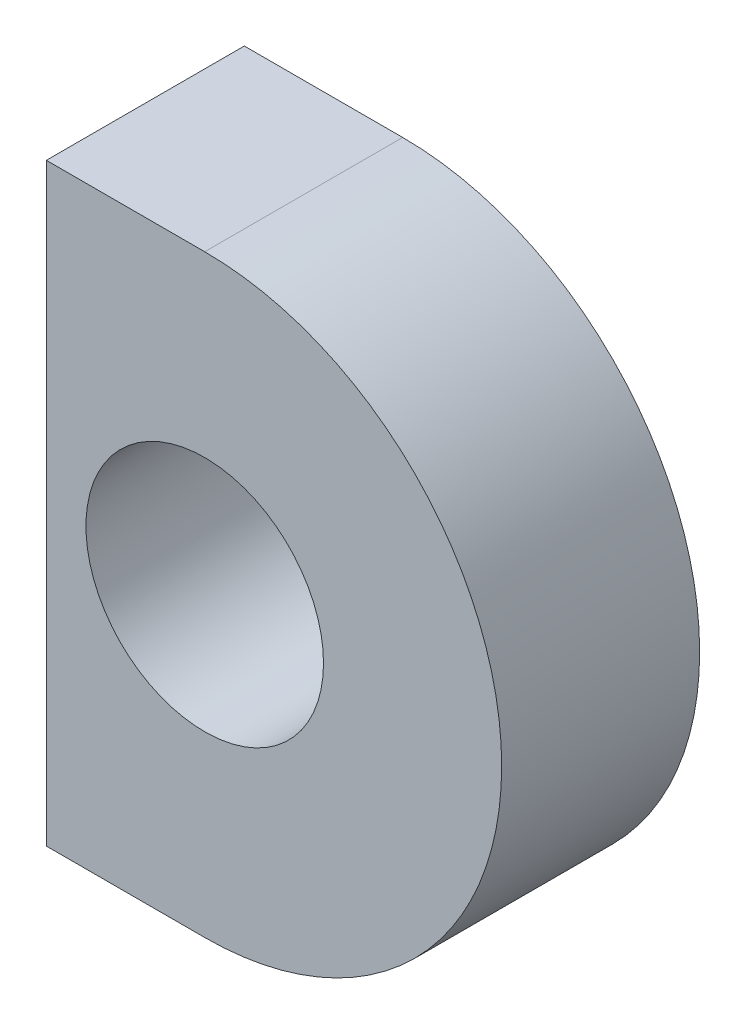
ISO-10303-21;
HEADER;
FILE_DESCRIPTION(('STEP AP214'),'2;1');
FILE_NAME('part.step','',(''),(''),'','','');
FILE_SCHEMA(('AUTOMOTIVE_DESIGN { 1 0 10303 214 1 1 1 1 }'));
ENDSEC;
DATA;
#1=APPLICATION_CONTEXT('core data for automotive mechanical design processes');
#2=APPLICATION_PROTOCOL_DEFINITION('international standard','automotive_design',2000,#1);
#3=PRODUCT_CONTEXT('',#1,'mechanical');
#4=PRODUCT('Part','Part','',(#3));
#5=PRODUCT_RELATED_PRODUCT_CATEGORY('part','',(#4));
#6=PRODUCT_DEFINITION_FORMATION('','',#4);
#7=PRODUCT_DEFINITION_CONTEXT('part definition',#1,'design');
#8=PRODUCT_DEFINITION('design','',#6,#7);
#9=PRODUCT_DEFINITION_SHAPE('','',#8);
#10=(LENGTH_UNIT() NAMED_UNIT(*) SI_UNIT(.MILLI.,.METRE.));
#11=(NAMED_UNIT(*) PLANE_ANGLE_UNIT() SI_UNIT($,.RADIAN.));
#12=(NAMED_UNIT(*) SI_UNIT($,.STERADIAN.) SOLID_ANGLE_UNIT());
#13=UNCERTAINTY_MEASURE_WITH_UNIT(LENGTH_MEASURE(1.E-05),#10,'distance_accuracy_value','');
#14=(GEOMETRIC_REPRESENTATION_CONTEXT(3) GLOBAL_UNCERTAINTY_ASSIGNED_CONTEXT((#13)) GLOBAL_UNIT_ASSIGNED_CONTEXT((#10,
#11,#12)) REPRESENTATION_CONTEXT('',''));
#15=CARTESIAN_POINT('',(0.,0.,0.));
#16=DIRECTION('',(0.,0.,1.));
#17=DIRECTION('',(1.,0.,0.));
#18=AXIS2_PLACEMENT_3D('',#15,#16,#17);
#19=CARTESIAN_POINT('',(0.,0.,10.));
#20=DIRECTION('',(1.,0.,0.));
#21=DIRECTION('',(0.,1.,0.));
#22=AXIS2_PLACEMENT_3D('',#19,#20,#21);
#23=PLANE('',#22);
#24=DIRECTION('',(0.,1.,0.));
#25=VECTOR('',#24,1.);
#26=CARTESIAN_POINT('',(0.,0.,7.99999999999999));
#27=LINE('',#26,#25);
#28=CARTESIAN_POINT('',(0.,-30.,7.99999999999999));
#29=VERTEX_POINT('',#28);
#30=CARTESIAN_POINT('',(0.,-2.,7.99999999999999));
#31=VERTEX_POINT('',#30);
#32=EDGE_CURVE('E122',#29,#31,#27,.T.);
#33=ORIENTED_EDGE('',*,*,#32,.T.);
#34=DIRECTION('',(0.,0.,-1.));
#35=VECTOR('',#34,1.);
#36=CARTESIAN_POINT('',(0.,-2.,10.));
#37=LINE('',#36,#35);
#38=CARTESIAN_POINT('',(0.,-2.,2.));
#39=VERTEX_POINT('',#38);
#40=EDGE_CURVE('E134',#31,#39,#37,.T.);
#41=ORIENTED_EDGE('',*,*,#40,.T.);
#42=DIRECTION('',(0.,-1.,0.));
#43=VECTOR('',#42,1.);
#44=CARTESIAN_POINT('',(0.,0.,2.));
#45=LINE('',#44,#43);
#46=CARTESIAN_POINT('',(0.,-30.,2.));
#47=VERTEX_POINT('',#46);
#48=EDGE_CURVE('E124',#39,#47,#45,.T.);
#49=ORIENTED_EDGE('',*,*,#48,.T.);
#50=DIRECTION('',(0.,0.,-1.));
#51=VECTOR('',#50,1.);
#52=CARTESIAN_POINT('',(0.,-30.,10.));
#53=LINE('',#52,#51);
#54=EDGE_CURVE('E103',#29,#47,#53,.T.);
#55=ORIENTED_EDGE('',*,*,#54,.F.);
#56=EDGE_LOOP('',(#33,#41,#49,#55));
#57=FACE_BOUND('',#56,.T.);
#58=ADVANCED_FACE('F30',(#57),#23,.F.);
#59=CARTESIAN_POINT('',(0.,-30.,10.));
#60=DIRECTION('',(0.,1.,0.));
#61=DIRECTION('',(0.,0.,1.));
#62=AXIS2_PLACEMENT_3D('',#59,#60,#61);
#63=PLANE('',#62);
#64=ORIENTED_EDGE('',*,*,#54,.T.);
#65=DIRECTION('',(-0.707106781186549,0.,0.707106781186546));
#66=VECTOR('',#65,1.);
#67=CARTESIAN_POINT('',(0.,-30.,2.));
#68=LINE('',#67,#66);
#69=CARTESIAN_POINT('',(2.00000000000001,-30.,0.));
#70=VERTEX_POINT('',#69);
#71=EDGE_CURVE('E128',#47,#70,#68,.F.);
#72=ORIENTED_EDGE('',*,*,#71,.T.);
#73=DIRECTION('',(1.,0.,0.));
#74=VECTOR('',#73,1.);
#75=CARTESIAN_POINT('',(0.,-30.,0.));
#76=LINE('',#75,#74);
#77=CARTESIAN_POINT('',(10.,-30.,0.));
#78=VERTEX_POINT('',#77);
#79=EDGE_CURVE('E100',#70,#78,#76,.T.);
#80=ORIENTED_EDGE('',*,*,#79,.T.);
#81=DIRECTION('',(0.,0.,-1.));
#82=VECTOR('',#81,1.);
#83=CARTESIAN_POINT('',(10.,-30.,10.));
#84=LINE('',#83,#82);
#85=CARTESIAN_POINT('',(10.,-30.,10.));
#86=VERTEX_POINT('',#85);
#87=EDGE_CURVE('E96',#86,#78,#84,.T.);
#88=ORIENTED_EDGE('',*,*,#87,.F.);
#89=DIRECTION('',(1.,0.,0.));
#90=VECTOR('',#89,1.);
#91=CARTESIAN_POINT('',(0.,-30.,10.));
#92=LINE('',#91,#90);
#93=CARTESIAN_POINT('',(2.00000000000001,-30.,10.));
#94=VERTEX_POINT('',#93);
#95=EDGE_CURVE('E84',#94,#86,#92,.T.);
#96=ORIENTED_EDGE('',*,*,#95,.F.);
#97=DIRECTION('',(-0.707106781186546,0.,-0.707106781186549));
#98=VECTOR('',#97,1.);
#99=CARTESIAN_POINT('',(2.,-30.,10.));
#100=LINE('',#99,#98);
#101=EDGE_CURVE('E126',#94,#29,#100,.T.);
#102=ORIENTED_EDGE('',*,*,#101,.T.);
#103=EDGE_LOOP('',(#64,#72,#80,#88,#96,#102));
#104=FACE_BOUND('',#103,.T.);
#105=ADVANCED_FACE('F98',(#104),#63,.F.);
#106=CARTESIAN_POINT('',(10.,-15.,10.));
#107=DIRECTION('',(0.,0.,-1.));
#108=DIRECTION('',(-1.,0.,0.));
#109=AXIS2_PLACEMENT_3D('',#106,#107,#108);
#110=CYLINDRICAL_SURFACE('',#109,15.);
#111=CARTESIAN_POINT('',(10.,-15.,0.));
#112=DIRECTION('',(0.,0.,1.));
#113=DIRECTION('',(1.,0.,0.));
#114=AXIS2_PLACEMENT_3D('',#111,#112,#113);
#115=CIRCLE('',#114,15.);
#116=CARTESIAN_POINT('',(10.,0.,0.));
#117=VERTEX_POINT('',#116);
#118=EDGE_CURVE('E115',#78,#117,#115,.T.);
#119=ORIENTED_EDGE('',*,*,#118,.T.);
#120=DIRECTION('',(0.,0.,-1.));
#121=VECTOR('',#120,1.);
#122=CARTESIAN_POINT('',(10.,0.,10.));
#123=LINE('',#122,#121);
#124=CARTESIAN_POINT('',(10.,0.,10.));
#125=VERTEX_POINT('',#124);
#126=EDGE_CURVE('E104',#125,#117,#123,.T.);
#127=ORIENTED_EDGE('',*,*,#126,.F.);
#128=CARTESIAN_POINT('',(10.,-15.,10.));
#129=DIRECTION('',(0.,0.,1.));
#130=DIRECTION('',(1.,0.,0.));
#131=AXIS2_PLACEMENT_3D('',#128,#129,#130);
#132=CIRCLE('',#131,15.);
#133=EDGE_CURVE('E89',#86,#125,#132,.T.);
#134=ORIENTED_EDGE('',*,*,#133,.F.);
#135=ORIENTED_EDGE('',*,*,#87,.T.);
#136=EDGE_LOOP('',(#119,#127,#134,#135));
#137=FACE_BOUND('',#136,.T.);
#138=ADVANCED_FACE('F106',(#137),#110,.T.);
#139=CARTESIAN_POINT('',(0.,0.,10.));
#140=DIRECTION('',(0.,-1.,0.));
#141=DIRECTION('',(0.,0.,-1.));
#142=AXIS2_PLACEMENT_3D('',#139,#140,#141);
#143=PLANE('',#142);
#144=DIRECTION('',(-1.,0.,0.));
#145=VECTOR('',#144,1.);
#146=CARTESIAN_POINT('',(0.,0.,0.));
#147=LINE('',#146,#145);
#148=CARTESIAN_POINT('',(2.00000000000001,0.,0.));
#149=VERTEX_POINT('',#148);
#150=EDGE_CURVE('E93',#117,#149,#147,.T.);
#151=ORIENTED_EDGE('',*,*,#150,.T.);
#152=DIRECTION('',(0.,0.,1.));
#153=VECTOR('',#152,1.);
#154=CARTESIAN_POINT('',(2.,0.,10.));
#155=LINE('',#154,#153);
#156=CARTESIAN_POINT('',(2.,0.,10.));
#157=VERTEX_POINT('',#156);
#158=EDGE_CURVE('E38',#149,#157,#155,.T.);
#159=ORIENTED_EDGE('',*,*,#158,.T.);
#160=DIRECTION('',(-1.,0.,0.));
#161=VECTOR('',#160,1.);
#162=CARTESIAN_POINT('',(0.,0.,10.));
#163=LINE('',#162,#161);
#164=EDGE_CURVE('E109',#125,#157,#163,.T.);
#165=ORIENTED_EDGE('',*,*,#164,.F.);
#166=ORIENTED_EDGE('',*,*,#126,.T.);
#167=EDGE_LOOP('',(#151,#159,#165,#166));
#168=FACE_BOUND('',#167,.T.);
#169=ADVANCED_FACE('F137',(#168),#143,.F.);
#170=CARTESIAN_POINT('',(10.,-15.,10.));
#171=DIRECTION('',(0.,0.,1.));
#172=DIRECTION('',(1.,0.,0.));
#173=AXIS2_PLACEMENT_3D('',#170,#171,#172);
#174=PLANE('',#173);
#175=CARTESIAN_POINT('',(10.,-15.,10.));
#176=DIRECTION('',(0.,0.,1.));
#177=DIRECTION('',(1.,0.,0.));
#178=AXIS2_PLACEMENT_3D('',#175,#176,#177);
#179=CIRCLE('',#178,6.);
#180=CARTESIAN_POINT('',(16.,-15.,10.));
#181=VERTEX_POINT('',#180);
#182=EDGE_CURVE('E233',#181,#181,#179,.T.);
#183=ORIENTED_EDGE('',*,*,#182,.F.);
#184=EDGE_LOOP('',(#183));
#185=FACE_BOUND('',#184,.T.);
#186=ORIENTED_EDGE('',*,*,#164,.T.);
#187=DIRECTION('',(0.,-1.,0.));
#188=VECTOR('',#187,1.);
#189=CARTESIAN_POINT('',(2.00000000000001,-30.,10.));
#190=LINE('',#189,#188);
#191=EDGE_CURVE('E91',#157,#94,#190,.T.);
#192=ORIENTED_EDGE('',*,*,#191,.T.);
#193=ORIENTED_EDGE('',*,*,#95,.T.);
#194=ORIENTED_EDGE('',*,*,#133,.T.);
#195=EDGE_LOOP('',(#186,#192,#193,#194));
#196=FACE_BOUND('',#195,.T.);
#197=ADVANCED_FACE('F87',(#185,#196),#174,.T.);
#198=CARTESIAN_POINT('',(10.,-15.,0.));
#199=DIRECTION('',(0.,0.,1.));
#200=DIRECTION('',(1.,0.,0.));
#201=AXIS2_PLACEMENT_3D('',#198,#199,#200);
#202=PLANE('',#201);
#203=CARTESIAN_POINT('',(10.,-15.,0.));
#204=DIRECTION('',(0.,0.,1.));
#205=DIRECTION('',(1.,0.,0.));
#206=AXIS2_PLACEMENT_3D('',#203,#204,#205);
#207=CIRCLE('',#206,6.);
#208=CARTESIAN_POINT('',(16.,-15.,0.));
#209=VERTEX_POINT('',#208);
#210=EDGE_CURVE('E116',#209,#209,#207,.T.);
#211=ORIENTED_EDGE('',*,*,#210,.T.);
#212=EDGE_LOOP('',(#211));
#213=FACE_BOUND('',#212,.T.);
#214=ORIENTED_EDGE('',*,*,#79,.F.);
#215=DIRECTION('',(0.,1.,0.));
#216=VECTOR('',#215,1.);
#217=CARTESIAN_POINT('',(2.00000000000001,-15.,0.));
#218=LINE('',#217,#216);
#219=EDGE_CURVE('E130',#70,#149,#218,.T.);
#220=ORIENTED_EDGE('',*,*,#219,.T.);
#221=ORIENTED_EDGE('',*,*,#150,.F.);
#222=ORIENTED_EDGE('',*,*,#118,.F.);
#223=EDGE_LOOP('',(#214,#220,#221,#222));
#224=FACE_BOUND('',#223,.T.);
#225=ADVANCED_FACE('F148',(#213,#224),#202,.F.);
#226=CARTESIAN_POINT('',(10.,-15.,0.));
#227=DIRECTION('',(0.,0.,1.));
#228=DIRECTION('',(1.,0.,0.));
#229=AXIS2_PLACEMENT_3D('',#226,#227,#228);
#230=CYLINDRICAL_SURFACE('',#229,6.);
#231=ORIENTED_EDGE('',*,*,#210,.F.);
#232=EDGE_LOOP('',(#231));
#233=FACE_BOUND('',#232,.T.);
#234=ORIENTED_EDGE('',*,*,#182,.T.);
#235=EDGE_LOOP('',(#234));
#236=FACE_BOUND('',#235,.T.);
#237=ADVANCED_FACE('F150',(#233,#236),#230,.F.);
#238=CARTESIAN_POINT('',(0.,0.,2.));
#239=DIRECTION('',(0.707106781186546,0.,0.707106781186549));
#240=DIRECTION('',(0.707106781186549,0.,-0.707106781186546));
#241=AXIS2_PLACEMENT_3D('',#238,#239,#240);
#242=PLANE('',#241);
#243=ORIENTED_EDGE('',*,*,#48,.F.);
#244=DIRECTION('',(0.577350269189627,0.577350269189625,-0.577350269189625));
#245=VECTOR('',#244,1.);
#246=CARTESIAN_POINT('',(0.666666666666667,-1.33333333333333,1.33333333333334));
#247=LINE('',#246,#245);
#248=EDGE_CURVE('E51',#39,#149,#247,.T.);
#249=ORIENTED_EDGE('',*,*,#248,.T.);
#250=ORIENTED_EDGE('',*,*,#219,.F.);
#251=ORIENTED_EDGE('',*,*,#71,.F.);
#252=EDGE_LOOP('',(#243,#249,#250,#251));
#253=FACE_BOUND('',#252,.T.);
#254=ADVANCED_FACE('F145',(#253),#242,.F.);
#255=CARTESIAN_POINT('',(2.,-15.,10.));
#256=DIRECTION('',(-0.707106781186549,0.,0.707106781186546));
#257=DIRECTION('',(0.707106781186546,0.,0.707106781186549));
#258=AXIS2_PLACEMENT_3D('',#255,#256,#257);
#259=PLANE('',#258);
#260=ORIENTED_EDGE('',*,*,#191,.F.);
#261=DIRECTION('',(0.577350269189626,0.577350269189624,0.577350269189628));
#262=VECTOR('',#261,1.);
#263=CARTESIAN_POINT('',(-2.99999999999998,-4.99999999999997,5.));
#264=LINE('',#263,#262);
#265=EDGE_CURVE('E11',#157,#31,#264,.F.);
#266=ORIENTED_EDGE('',*,*,#265,.T.);
#267=ORIENTED_EDGE('',*,*,#32,.F.);
#268=ORIENTED_EDGE('',*,*,#101,.F.);
#269=EDGE_LOOP('',(#260,#266,#267,#268));
#270=FACE_BOUND('',#269,.T.);
#271=ADVANCED_FACE('F139',(#270),#259,.T.);
#272=CARTESIAN_POINT('',(0.,-2.,10.));
#273=DIRECTION('',(0.707106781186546,-0.707106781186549,0.));
#274=DIRECTION('',(0.707106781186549,0.707106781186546,0.));
#275=AXIS2_PLACEMENT_3D('',#272,#273,#274);
#276=PLANE('',#275);
#277=ORIENTED_EDGE('',*,*,#265,.F.);
#278=ORIENTED_EDGE('',*,*,#158,.F.);
#279=ORIENTED_EDGE('',*,*,#248,.F.);
#280=ORIENTED_EDGE('',*,*,#40,.F.);
#281=EDGE_LOOP('',(#277,#278,#279,#280));
#282=FACE_BOUND('',#281,.T.);
#283=ADVANCED_FACE('F32',(#282),#276,.F.);
#284=CLOSED_SHELL('',(#58,#105,#138,#169,#197,#225,#237,#254,#271,#283));
#285=MANIFOLD_SOLID_BREP('B2',#284);
#286=ADVANCED_BREP_SHAPE_REPRESENTATION('',(#18,#285),#14);
#287=SHAPE_DEFINITION_REPRESENTATION(#9,#286);
ENDSEC;
END-ISO-10303-21;
